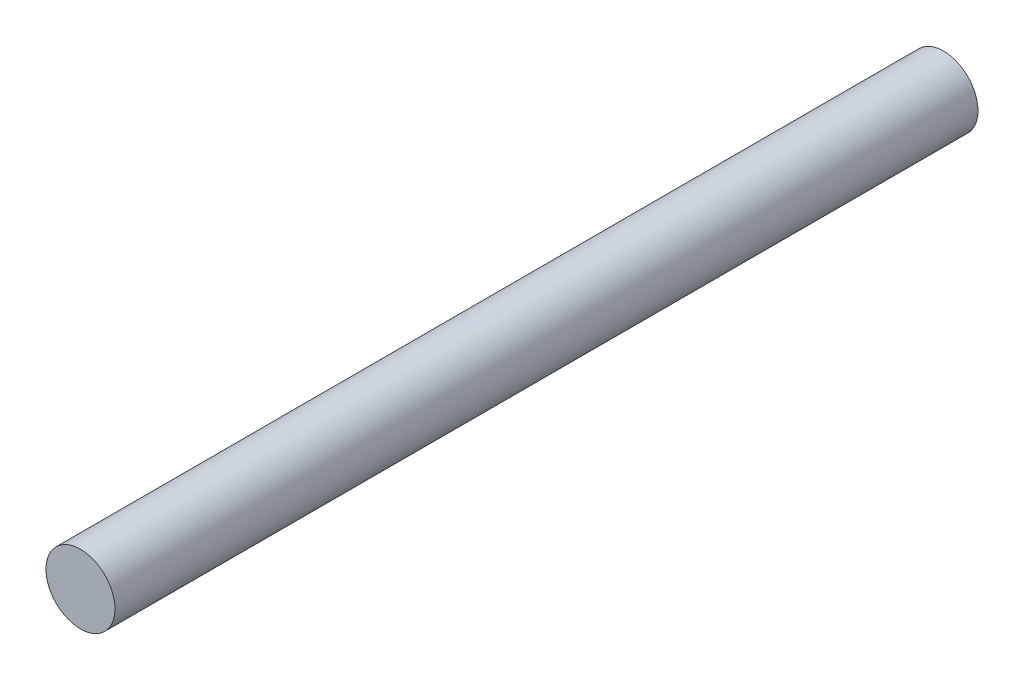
ISO-10303-21;
HEADER;
FILE_DESCRIPTION(('STEP AP214'),'2;1');
FILE_NAME('part.step','',(''),(''),'','','');
FILE_SCHEMA(('AUTOMOTIVE_DESIGN { 1 0 10303 214 1 1 1 1 }'));
ENDSEC;
DATA;
#1=APPLICATION_CONTEXT('core data for automotive mechanical design processes');
#2=APPLICATION_PROTOCOL_DEFINITION('international standard','automotive_design',2000,#1);
#3=PRODUCT_CONTEXT('',#1,'mechanical');
#4=PRODUCT('Part','Part','',(#3));
#5=PRODUCT_RELATED_PRODUCT_CATEGORY('part','',(#4));
#6=PRODUCT_DEFINITION_FORMATION('','',#4);
#7=PRODUCT_DEFINITION_CONTEXT('part definition',#1,'design');
#8=PRODUCT_DEFINITION('design','',#6,#7);
#9=PRODUCT_DEFINITION_SHAPE('','',#8);
#10=(LENGTH_UNIT() NAMED_UNIT(*) SI_UNIT(.MILLI.,.METRE.));
#11=(NAMED_UNIT(*) PLANE_ANGLE_UNIT() SI_UNIT($,.RADIAN.));
#12=(NAMED_UNIT(*) SI_UNIT($,.STERADIAN.) SOLID_ANGLE_UNIT());
#13=UNCERTAINTY_MEASURE_WITH_UNIT(LENGTH_MEASURE(1.E-05),#10,'distance_accuracy_value','');
#14=(GEOMETRIC_REPRESENTATION_CONTEXT(3) GLOBAL_UNCERTAINTY_ASSIGNED_CONTEXT((#13)) GLOBAL_UNIT_ASSIGNED_CONTEXT((#10,
#11,#12)) REPRESENTATION_CONTEXT('',''));
#15=CARTESIAN_POINT('',(0.,0.,0.));
#16=DIRECTION('',(0.,0.,1.));
#17=DIRECTION('',(1.,0.,0.));
#18=AXIS2_PLACEMENT_3D('',#15,#16,#17);
#19=CARTESIAN_POINT('',(0.,0.,-750.));
#20=DIRECTION('',(0.,0.,1.));
#21=DIRECTION('',(1.,0.,0.));
#22=AXIS2_PLACEMENT_3D('',#19,#20,#21);
#23=CYLINDRICAL_SURFACE('',#22,30.);
#24=CARTESIAN_POINT('',(0.,0.,-750.));
#25=DIRECTION('',(0.,0.,1.));
#26=DIRECTION('',(1.,0.,0.));
#27=AXIS2_PLACEMENT_3D('',#24,#25,#26);
#28=CIRCLE('',#27,30.);
#29=CARTESIAN_POINT('',(30.,0.,-750.));
#30=VERTEX_POINT('',#29);
#31=EDGE_CURVE('E10',#30,#30,#28,.T.);
#32=ORIENTED_EDGE('',*,*,#31,.T.);
#33=EDGE_LOOP('',(#32));
#34=FACE_BOUND('',#33,.T.);
#35=CARTESIAN_POINT('',(0.,0.,0.));
#36=DIRECTION('',(0.,0.,1.));
#37=DIRECTION('',(1.,0.,0.));
#38=AXIS2_PLACEMENT_3D('',#35,#36,#37);
#39=CIRCLE('',#38,30.);
#40=CARTESIAN_POINT('',(30.,0.,0.));
#41=VERTEX_POINT('',#40);
#42=EDGE_CURVE('E40',#41,#41,#39,.T.);
#43=ORIENTED_EDGE('',*,*,#42,.F.);
#44=EDGE_LOOP('',(#43));
#45=FACE_BOUND('',#44,.T.);
#46=ADVANCED_FACE('F37',(#34,#45),#23,.T.);
#47=CARTESIAN_POINT('',(0.,0.,-750.));
#48=DIRECTION('',(0.,0.,1.));
#49=DIRECTION('',(1.,0.,0.));
#50=AXIS2_PLACEMENT_3D('',#47,#48,#49);
#51=PLANE('',#50);
#52=ORIENTED_EDGE('',*,*,#31,.F.);
#53=EDGE_LOOP('',(#52));
#54=FACE_BOUND('',#53,.T.);
#55=ADVANCED_FACE('F54',(#54),#51,.F.);
#56=CARTESIAN_POINT('',(0.,0.,0.));
#57=DIRECTION('',(0.,0.,1.));
#58=DIRECTION('',(1.,0.,0.));
#59=AXIS2_PLACEMENT_3D('',#56,#57,#58);
#60=PLANE('',#59);
#61=ORIENTED_EDGE('',*,*,#42,.T.);
#62=EDGE_LOOP('',(#61));
#63=FACE_BOUND('',#62,.T.);
#64=ADVANCED_FACE('F51',(#63),#60,.T.);
#65=CLOSED_SHELL('',(#46,#55,#64));
#66=MANIFOLD_SOLID_BREP('B2',#65);
#67=ADVANCED_BREP_SHAPE_REPRESENTATION('',(#18,#66),#14);
#68=SHAPE_DEFINITION_REPRESENTATION(#9,#67);
ENDSEC;
END-ISO-10303-21;
